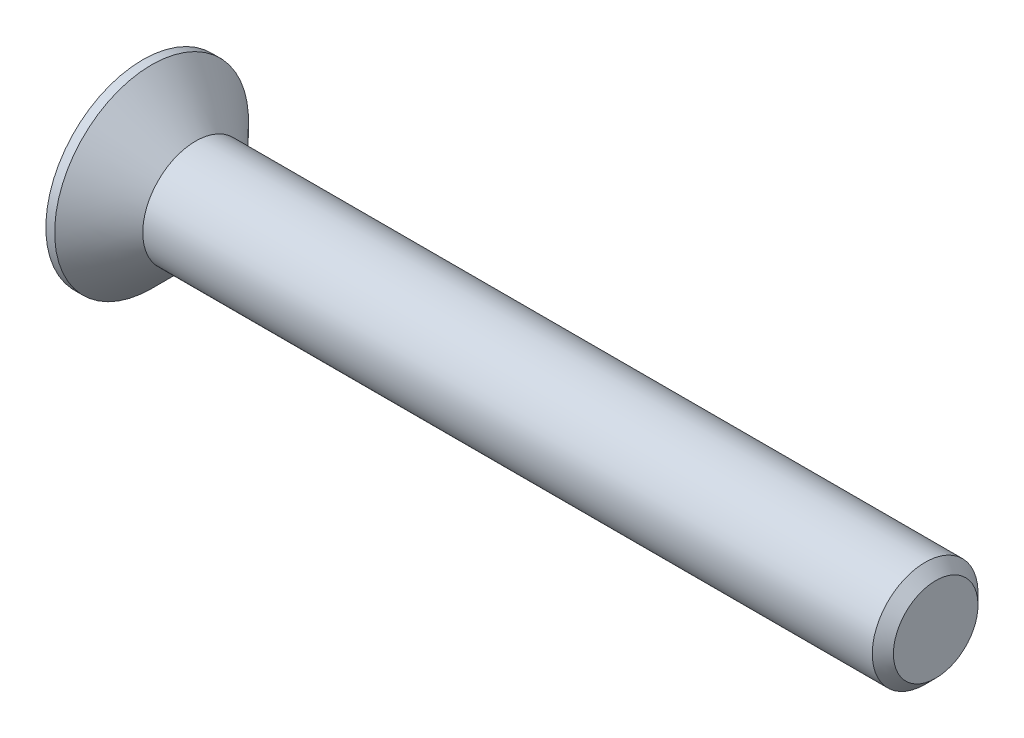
ISO-10303-21;
HEADER;
FILE_DESCRIPTION(('STEP AP214'),'2;1');
FILE_NAME('part.step','',(''),(''),'','','');
FILE_SCHEMA(('AUTOMOTIVE_DESIGN { 1 0 10303 214 1 1 1 1 }'));
ENDSEC;
DATA;
#1=APPLICATION_CONTEXT('core data for automotive mechanical design processes');
#2=APPLICATION_PROTOCOL_DEFINITION('international standard','automotive_design',2000,#1);
#3=PRODUCT_CONTEXT('',#1,'mechanical');
#4=PRODUCT('Part','Part','',(#3));
#5=PRODUCT_RELATED_PRODUCT_CATEGORY('part','',(#4));
#6=PRODUCT_DEFINITION_FORMATION('','',#4);
#7=PRODUCT_DEFINITION_CONTEXT('part definition',#1,'design');
#8=PRODUCT_DEFINITION('design','',#6,#7);
#9=PRODUCT_DEFINITION_SHAPE('','',#8);
#10=(LENGTH_UNIT() NAMED_UNIT(*) SI_UNIT(.MILLI.,.METRE.));
#11=(NAMED_UNIT(*) PLANE_ANGLE_UNIT() SI_UNIT($,.RADIAN.));
#12=(NAMED_UNIT(*) SI_UNIT($,.STERADIAN.) SOLID_ANGLE_UNIT());
#13=UNCERTAINTY_MEASURE_WITH_UNIT(LENGTH_MEASURE(1.E-05),#10,'distance_accuracy_value','');
#14=(GEOMETRIC_REPRESENTATION_CONTEXT(3) GLOBAL_UNCERTAINTY_ASSIGNED_CONTEXT((#13)) GLOBAL_UNIT_ASSIGNED_CONTEXT((#10,
#11,#12)) REPRESENTATION_CONTEXT('',''));
#15=CARTESIAN_POINT('',(0.,0.,0.));
#16=DIRECTION('',(0.,0.,1.));
#17=DIRECTION('',(1.,0.,0.));
#18=AXIS2_PLACEMENT_3D('',#15,#16,#17);
#19=CARTESIAN_POINT('',(0.,0.,0.));
#20=DIRECTION('',(-1.,0.,0.));
#21=DIRECTION('',(0.,-1.,0.));
#22=AXIS2_PLACEMENT_3D('',#19,#20,#21);
#23=CONICAL_SURFACE('',#22,3.,0.78539816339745);
#24=CARTESIAN_POINT('',(-2.49999999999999,0.,0.));
#25=DIRECTION('',(-1.,0.,0.));
#26=DIRECTION('',(0.,-1.,0.));
#27=AXIS2_PLACEMENT_3D('',#24,#25,#26);
#28=CIRCLE('',#27,5.5);
#29=CARTESIAN_POINT('',(-2.49999999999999,-5.5,0.));
#30=VERTEX_POINT('',#29);
#31=EDGE_CURVE('E189',#30,#30,#28,.T.);
#32=ORIENTED_EDGE('',*,*,#31,.F.);
#33=EDGE_LOOP('',(#32));
#34=FACE_BOUND('',#33,.T.);
#35=CARTESIAN_POINT('',(0.,0.,0.));
#36=DIRECTION('',(-1.,0.,0.));
#37=DIRECTION('',(0.,-1.,0.));
#38=AXIS2_PLACEMENT_3D('',#35,#36,#37);
#39=CIRCLE('',#38,3.);
#40=CARTESIAN_POINT('',(0.,-3.,0.));
#41=VERTEX_POINT('',#40);
#42=EDGE_CURVE('E212',#41,#41,#39,.T.);
#43=ORIENTED_EDGE('',*,*,#42,.T.);
#44=EDGE_LOOP('',(#43));
#45=FACE_BOUND('',#44,.T.);
#46=ADVANCED_FACE('F33',(#34,#45),#23,.T.);
#47=CARTESIAN_POINT('',(-3.,0.,0.));
#48=DIRECTION('',(-1.,0.,0.));
#49=DIRECTION('',(0.,-1.,0.));
#50=AXIS2_PLACEMENT_3D('',#47,#48,#49);
#51=CYLINDRICAL_SURFACE('',#50,3.);
#52=CARTESIAN_POINT('',(41.4,0.,0.));
#53=DIRECTION('',(-1.,0.,0.));
#54=DIRECTION('',(0.,-1.,0.));
#55=AXIS2_PLACEMENT_3D('',#52,#53,#54);
#56=CIRCLE('',#55,3.);
#57=CARTESIAN_POINT('',(41.4,-3.,0.));
#58=VERTEX_POINT('',#57);
#59=EDGE_CURVE('E41',#58,#58,#56,.T.);
#60=ORIENTED_EDGE('',*,*,#59,.T.);
#61=EDGE_LOOP('',(#60));
#62=FACE_BOUND('',#61,.T.);
#63=ORIENTED_EDGE('',*,*,#42,.F.);
#64=EDGE_LOOP('',(#63));
#65=FACE_BOUND('',#64,.T.);
#66=ADVANCED_FACE('F217',(#62,#65),#51,.T.);
#67=CARTESIAN_POINT('',(42.,0.,0.));
#68=DIRECTION('',(-1.,0.,0.));
#69=DIRECTION('',(0.,-1.,0.));
#70=AXIS2_PLACEMENT_3D('',#67,#68,#69);
#71=PLANE('',#70);
#72=CARTESIAN_POINT('',(42.,0.,0.));
#73=DIRECTION('',(-1.,0.,0.));
#74=DIRECTION('',(0.,-1.,0.));
#75=AXIS2_PLACEMENT_3D('',#72,#73,#74);
#76=CIRCLE('',#75,2.40000000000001);
#77=CARTESIAN_POINT('',(42.,-2.40000000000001,0.));
#78=VERTEX_POINT('',#77);
#79=EDGE_CURVE('E11',#78,#78,#76,.F.);
#80=ORIENTED_EDGE('',*,*,#79,.T.);
#81=EDGE_LOOP('',(#80));
#82=FACE_BOUND('',#81,.T.);
#83=ADVANCED_FACE('F239',(#82),#71,.F.);
#84=CARTESIAN_POINT('',(-3.,5.5,0.));
#85=DIRECTION('',(1.,0.,0.));
#86=DIRECTION('',(0.,1.,0.));
#87=AXIS2_PLACEMENT_3D('',#84,#85,#86);
#88=PLANE('',#87);
#89=DIRECTION('',(0.,0.,-1.));
#90=VECTOR('',#89,1.);
#91=CARTESIAN_POINT('',(-3.,0.825,-3.3));
#92=LINE('',#91,#90);
#93=CARTESIAN_POINT('',(-3.,0.825,-0.825));
#94=VERTEX_POINT('',#93);
#95=CARTESIAN_POINT('',(-3.,0.825,-3.3));
#96=VERTEX_POINT('',#95);
#97=EDGE_CURVE('E158',#94,#96,#92,.T.);
#98=ORIENTED_EDGE('',*,*,#97,.F.);
#99=DIRECTION('',(0.,-1.,0.));
#100=VECTOR('',#99,1.);
#101=CARTESIAN_POINT('',(-3.,0.825,-0.825));
#102=LINE('',#101,#100);
#103=CARTESIAN_POINT('',(-3.,3.3,-0.825));
#104=VERTEX_POINT('',#103);
#105=EDGE_CURVE('E48',#104,#94,#102,.T.);
#106=ORIENTED_EDGE('',*,*,#105,.F.);
#107=DIRECTION('',(0.,0.,-1.));
#108=VECTOR('',#107,1.);
#109=CARTESIAN_POINT('',(-3.,3.3,-0.825));
#110=LINE('',#109,#108);
#111=CARTESIAN_POINT('',(-3.,3.3,0.825));
#112=VERTEX_POINT('',#111);
#113=EDGE_CURVE('E185',#112,#104,#110,.T.);
#114=ORIENTED_EDGE('',*,*,#113,.F.);
#115=DIRECTION('',(0.,1.,0.));
#116=VECTOR('',#115,1.);
#117=CARTESIAN_POINT('',(-3.,3.3,0.825));
#118=LINE('',#117,#116);
#119=CARTESIAN_POINT('',(-3.,0.825,0.825));
#120=VERTEX_POINT('',#119);
#121=EDGE_CURVE('E183',#120,#112,#118,.T.);
#122=ORIENTED_EDGE('',*,*,#121,.F.);
#123=DIRECTION('',(0.,0.,-1.));
#124=VECTOR('',#123,1.);
#125=CARTESIAN_POINT('',(-3.,0.825,0.825));
#126=LINE('',#125,#124);
#127=CARTESIAN_POINT('',(-3.,0.825,3.3));
#128=VERTEX_POINT('',#127);
#129=EDGE_CURVE('E132',#128,#120,#126,.T.);
#130=ORIENTED_EDGE('',*,*,#129,.F.);
#131=DIRECTION('',(0.,1.,0.));
#132=VECTOR('',#131,1.);
#133=CARTESIAN_POINT('',(-3.,0.825,3.3));
#134=LINE('',#133,#132);
#135=CARTESIAN_POINT('',(-3.,-0.825,3.3));
#136=VERTEX_POINT('',#135);
#137=EDGE_CURVE('E179',#136,#128,#134,.T.);
#138=ORIENTED_EDGE('',*,*,#137,.F.);
#139=DIRECTION('',(0.,0.,1.));
#140=VECTOR('',#139,1.);
#141=CARTESIAN_POINT('',(-3.,-0.825,3.3));
#142=LINE('',#141,#140);
#143=CARTESIAN_POINT('',(-3.,-0.825,0.825));
#144=VERTEX_POINT('',#143);
#145=EDGE_CURVE('E176',#144,#136,#142,.T.);
#146=ORIENTED_EDGE('',*,*,#145,.F.);
#147=DIRECTION('',(0.,1.,0.));
#148=VECTOR('',#147,1.);
#149=CARTESIAN_POINT('',(-3.,-0.825,0.825));
#150=LINE('',#149,#148);
#151=CARTESIAN_POINT('',(-3.,-3.3,0.825));
#152=VERTEX_POINT('',#151);
#153=EDGE_CURVE('E173',#152,#144,#150,.T.);
#154=ORIENTED_EDGE('',*,*,#153,.F.);
#155=DIRECTION('',(0.,0.,1.));
#156=VECTOR('',#155,1.);
#157=CARTESIAN_POINT('',(-3.,-3.3,0.825));
#158=LINE('',#157,#156);
#159=CARTESIAN_POINT('',(-3.,-3.3,-0.825));
#160=VERTEX_POINT('',#159);
#161=EDGE_CURVE('E170',#160,#152,#158,.T.);
#162=ORIENTED_EDGE('',*,*,#161,.F.);
#163=DIRECTION('',(0.,-1.,0.));
#164=VECTOR('',#163,1.);
#165=CARTESIAN_POINT('',(-3.,-3.3,-0.825));
#166=LINE('',#165,#164);
#167=CARTESIAN_POINT('',(-3.,-0.825,-0.825));
#168=VERTEX_POINT('',#167);
#169=EDGE_CURVE('E167',#168,#160,#166,.T.);
#170=ORIENTED_EDGE('',*,*,#169,.F.);
#171=DIRECTION('',(0.,0.,1.));
#172=VECTOR('',#171,1.);
#173=CARTESIAN_POINT('',(-3.,-0.825,-0.825));
#174=LINE('',#173,#172);
#175=CARTESIAN_POINT('',(-3.,-0.825,-3.3));
#176=VERTEX_POINT('',#175);
#177=EDGE_CURVE('E164',#176,#168,#174,.T.);
#178=ORIENTED_EDGE('',*,*,#177,.F.);
#179=DIRECTION('',(0.,-1.,0.));
#180=VECTOR('',#179,1.);
#181=CARTESIAN_POINT('',(-3.,-0.825,-3.3));
#182=LINE('',#181,#180);
#183=EDGE_CURVE('E161',#96,#176,#182,.T.);
#184=ORIENTED_EDGE('',*,*,#183,.F.);
#185=EDGE_LOOP('',(#98,#106,#114,#122,#130,#138,#146,#154,#162,#170,#178,#184));
#186=FACE_BOUND('',#185,.T.);
#187=CARTESIAN_POINT('',(-3.,0.,0.));
#188=DIRECTION('',(-1.,0.,0.));
#189=DIRECTION('',(0.,-1.,0.));
#190=AXIS2_PLACEMENT_3D('',#187,#188,#189);
#191=CIRCLE('',#190,5.5);
#192=CARTESIAN_POINT('',(-3.,-5.5,0.));
#193=VERTEX_POINT('',#192);
#194=EDGE_CURVE('E209',#193,#193,#191,.T.);
#195=ORIENTED_EDGE('',*,*,#194,.T.);
#196=EDGE_LOOP('',(#195));
#197=FACE_BOUND('',#196,.T.);
#198=ADVANCED_FACE('F230',(#186,#197),#88,.F.);
#199=CARTESIAN_POINT('',(-3.,0.,0.));
#200=DIRECTION('',(-1.,0.,0.));
#201=DIRECTION('',(0.,-1.,0.));
#202=AXIS2_PLACEMENT_3D('',#199,#200,#201);
#203=CYLINDRICAL_SURFACE('',#202,5.5);
#204=ORIENTED_EDGE('',*,*,#194,.F.);
#205=EDGE_LOOP('',(#204));
#206=FACE_BOUND('',#205,.T.);
#207=ORIENTED_EDGE('',*,*,#31,.T.);
#208=EDGE_LOOP('',(#207));
#209=FACE_BOUND('',#208,.T.);
#210=ADVANCED_FACE('F222',(#206,#209),#203,.T.);
#211=CARTESIAN_POINT('',(41.4,0.,0.));
#212=DIRECTION('',(-1.,0.,0.));
#213=DIRECTION('',(0.,-1.,0.));
#214=AXIS2_PLACEMENT_3D('',#211,#212,#213);
#215=CONICAL_SURFACE('',#214,3.,0.785398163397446);
#216=ORIENTED_EDGE('',*,*,#79,.F.);
#217=EDGE_LOOP('',(#216));
#218=FACE_BOUND('',#217,.T.);
#219=ORIENTED_EDGE('',*,*,#59,.F.);
#220=EDGE_LOOP('',(#219));
#221=FACE_BOUND('',#220,.T.);
#222=ADVANCED_FACE('F35',(#218,#221),#215,.T.);
#223=CARTESIAN_POINT('',(-0.5,0.825,-0.825));
#224=DIRECTION('',(0.,0.,-1.));
#225=DIRECTION('',(-1.,0.,0.));
#226=AXIS2_PLACEMENT_3D('',#223,#224,#225);
#227=PLANE('',#226);
#228=ORIENTED_EDGE('',*,*,#105,.T.);
#229=DIRECTION('',(-1.,0.,0.));
#230=VECTOR('',#229,1.);
#231=CARTESIAN_POINT('',(-0.5,0.825,-0.825));
#232=LINE('',#231,#230);
#233=CARTESIAN_POINT('',(-0.5,0.825,-0.825));
#234=VERTEX_POINT('',#233);
#235=EDGE_CURVE('E96',#234,#94,#232,.T.);
#236=ORIENTED_EDGE('',*,*,#235,.F.);
#237=DIRECTION('',(0.,-1.,0.));
#238=VECTOR('',#237,1.);
#239=CARTESIAN_POINT('',(-0.5,0.825,-0.825));
#240=LINE('',#239,#238);
#241=CARTESIAN_POINT('',(-0.5,3.3,-0.825));
#242=VERTEX_POINT('',#241);
#243=EDGE_CURVE('E187',#242,#234,#240,.T.);
#244=ORIENTED_EDGE('',*,*,#243,.F.);
#245=DIRECTION('',(-1.,0.,0.));
#246=VECTOR('',#245,1.);
#247=CARTESIAN_POINT('',(-0.5,3.3,-0.825));
#248=LINE('',#247,#246);
#249=EDGE_CURVE('E56',#242,#104,#248,.T.);
#250=ORIENTED_EDGE('',*,*,#249,.T.);
#251=EDGE_LOOP('',(#228,#236,#244,#250));
#252=FACE_BOUND('',#251,.T.);
#253=ADVANCED_FACE('F221',(#252),#227,.F.);
#254=CARTESIAN_POINT('',(-0.5,3.3,-0.825));
#255=DIRECTION('',(0.,1.,0.));
#256=DIRECTION('',(-1.,0.,0.));
#257=AXIS2_PLACEMENT_3D('',#254,#255,#256);
#258=PLANE('',#257);
#259=ORIENTED_EDGE('',*,*,#113,.T.);
#260=ORIENTED_EDGE('',*,*,#249,.F.);
#261=DIRECTION('',(0.,0.,-1.));
#262=VECTOR('',#261,1.);
#263=CARTESIAN_POINT('',(-0.5,3.3,-0.825));
#264=LINE('',#263,#262);
#265=CARTESIAN_POINT('',(-0.5,3.3,0.825));
#266=VERTEX_POINT('',#265);
#267=EDGE_CURVE('E144',#266,#242,#264,.T.);
#268=ORIENTED_EDGE('',*,*,#267,.F.);
#269=DIRECTION('',(-1.,0.,0.));
#270=VECTOR('',#269,1.);
#271=CARTESIAN_POINT('',(-0.5,3.3,0.825));
#272=LINE('',#271,#270);
#273=EDGE_CURVE('E136',#266,#112,#272,.T.);
#274=ORIENTED_EDGE('',*,*,#273,.T.);
#275=EDGE_LOOP('',(#259,#260,#268,#274));
#276=FACE_BOUND('',#275,.T.);
#277=ADVANCED_FACE('F228',(#276),#258,.F.);
#278=CARTESIAN_POINT('',(-0.5,3.3,0.825));
#279=DIRECTION('',(0.,0.,1.));
#280=DIRECTION('',(1.,0.,0.));
#281=AXIS2_PLACEMENT_3D('',#278,#279,#280);
#282=PLANE('',#281);
#283=ORIENTED_EDGE('',*,*,#121,.T.);
#284=ORIENTED_EDGE('',*,*,#273,.F.);
#285=DIRECTION('',(0.,1.,0.));
#286=VECTOR('',#285,1.);
#287=CARTESIAN_POINT('',(-0.5,3.3,0.825));
#288=LINE('',#287,#286);
#289=CARTESIAN_POINT('',(-0.5,0.825,0.825));
#290=VERTEX_POINT('',#289);
#291=EDGE_CURVE('E140',#290,#266,#288,.T.);
#292=ORIENTED_EDGE('',*,*,#291,.F.);
#293=DIRECTION('',(-1.,0.,0.));
#294=VECTOR('',#293,1.);
#295=CARTESIAN_POINT('',(-0.5,0.825,0.825));
#296=LINE('',#295,#294);
#297=EDGE_CURVE('E125',#290,#120,#296,.T.);
#298=ORIENTED_EDGE('',*,*,#297,.T.);
#299=EDGE_LOOP('',(#283,#284,#292,#298));
#300=FACE_BOUND('',#299,.T.);
#301=ADVANCED_FACE('F141',(#300),#282,.F.);
#302=CARTESIAN_POINT('',(-0.5,0.825,0.825));
#303=DIRECTION('',(0.,1.,0.));
#304=DIRECTION('',(-1.,0.,0.));
#305=AXIS2_PLACEMENT_3D('',#302,#303,#304);
#306=PLANE('',#305);
#307=ORIENTED_EDGE('',*,*,#129,.T.);
#308=ORIENTED_EDGE('',*,*,#297,.F.);
#309=DIRECTION('',(0.,0.,-1.));
#310=VECTOR('',#309,1.);
#311=CARTESIAN_POINT('',(-0.5,0.825,0.825));
#312=LINE('',#311,#310);
#313=CARTESIAN_POINT('',(-0.5,0.825,3.3));
#314=VERTEX_POINT('',#313);
#315=EDGE_CURVE('E129',#314,#290,#312,.T.);
#316=ORIENTED_EDGE('',*,*,#315,.F.);
#317=DIRECTION('',(-1.,0.,0.));
#318=VECTOR('',#317,1.);
#319=CARTESIAN_POINT('',(-0.5,0.825,3.3));
#320=LINE('',#319,#318);
#321=EDGE_CURVE('E137',#314,#128,#320,.T.);
#322=ORIENTED_EDGE('',*,*,#321,.T.);
#323=EDGE_LOOP('',(#307,#308,#316,#322));
#324=FACE_BOUND('',#323,.T.);
#325=ADVANCED_FACE('F127',(#324),#306,.F.);
#326=CARTESIAN_POINT('',(-0.5,0.825,3.3));
#327=DIRECTION('',(0.,0.,1.));
#328=DIRECTION('',(1.,0.,0.));
#329=AXIS2_PLACEMENT_3D('',#326,#327,#328);
#330=PLANE('',#329);
#331=ORIENTED_EDGE('',*,*,#137,.T.);
#332=ORIENTED_EDGE('',*,*,#321,.F.);
#333=DIRECTION('',(0.,1.,0.));
#334=VECTOR('',#333,1.);
#335=CARTESIAN_POINT('',(-0.5,0.825,3.3));
#336=LINE('',#335,#334);
#337=CARTESIAN_POINT('',(-0.5,-0.825,3.3));
#338=VERTEX_POINT('',#337);
#339=EDGE_CURVE('E150',#338,#314,#336,.T.);
#340=ORIENTED_EDGE('',*,*,#339,.F.);
#341=DIRECTION('',(-1.,0.,0.));
#342=VECTOR('',#341,1.);
#343=CARTESIAN_POINT('',(-0.5,-0.825,3.3));
#344=LINE('',#343,#342);
#345=EDGE_CURVE('E192',#338,#136,#344,.T.);
#346=ORIENTED_EDGE('',*,*,#345,.T.);
#347=EDGE_LOOP('',(#331,#332,#340,#346));
#348=FACE_BOUND('',#347,.T.);
#349=ADVANCED_FACE('F277',(#348),#330,.F.);
#350=CARTESIAN_POINT('',(-0.5,-0.825,3.3));
#351=DIRECTION('',(0.,-1.,0.));
#352=DIRECTION('',(1.,0.,0.));
#353=AXIS2_PLACEMENT_3D('',#350,#351,#352);
#354=PLANE('',#353);
#355=ORIENTED_EDGE('',*,*,#145,.T.);
#356=ORIENTED_EDGE('',*,*,#345,.F.);
#357=DIRECTION('',(0.,0.,1.));
#358=VECTOR('',#357,1.);
#359=CARTESIAN_POINT('',(-0.5,-0.825,3.3));
#360=LINE('',#359,#358);
#361=CARTESIAN_POINT('',(-0.5,-0.825,0.825));
#362=VERTEX_POINT('',#361);
#363=EDGE_CURVE('E152',#362,#338,#360,.T.);
#364=ORIENTED_EDGE('',*,*,#363,.F.);
#365=DIRECTION('',(-1.,0.,0.));
#366=VECTOR('',#365,1.);
#367=CARTESIAN_POINT('',(-0.5,-0.825,0.825));
#368=LINE('',#367,#366);
#369=EDGE_CURVE('E194',#362,#144,#368,.T.);
#370=ORIENTED_EDGE('',*,*,#369,.T.);
#371=EDGE_LOOP('',(#355,#356,#364,#370));
#372=FACE_BOUND('',#371,.T.);
#373=ADVANCED_FACE('F273',(#372),#354,.F.);
#374=CARTESIAN_POINT('',(-0.5,-0.825,0.825));
#375=DIRECTION('',(0.,0.,1.));
#376=DIRECTION('',(1.,0.,0.));
#377=AXIS2_PLACEMENT_3D('',#374,#375,#376);
#378=PLANE('',#377);
#379=ORIENTED_EDGE('',*,*,#153,.T.);
#380=ORIENTED_EDGE('',*,*,#369,.F.);
#381=DIRECTION('',(0.,1.,0.));
#382=VECTOR('',#381,1.);
#383=CARTESIAN_POINT('',(-0.5,-0.825,0.825));
#384=LINE('',#383,#382);
#385=CARTESIAN_POINT('',(-0.5,-3.3,0.825));
#386=VERTEX_POINT('',#385);
#387=EDGE_CURVE('E422',#386,#362,#384,.T.);
#388=ORIENTED_EDGE('',*,*,#387,.F.);
#389=DIRECTION('',(-1.,0.,0.));
#390=VECTOR('',#389,1.);
#391=CARTESIAN_POINT('',(-0.5,-3.3,0.825));
#392=LINE('',#391,#390);
#393=EDGE_CURVE('E196',#386,#152,#392,.T.);
#394=ORIENTED_EDGE('',*,*,#393,.T.);
#395=EDGE_LOOP('',(#379,#380,#388,#394));
#396=FACE_BOUND('',#395,.T.);
#397=ADVANCED_FACE('F269',(#396),#378,.F.);
#398=CARTESIAN_POINT('',(-0.5,-3.3,0.825));
#399=DIRECTION('',(0.,-1.,0.));
#400=DIRECTION('',(1.,0.,0.));
#401=AXIS2_PLACEMENT_3D('',#398,#399,#400);
#402=PLANE('',#401);
#403=ORIENTED_EDGE('',*,*,#161,.T.);
#404=ORIENTED_EDGE('',*,*,#393,.F.);
#405=DIRECTION('',(0.,0.,1.));
#406=VECTOR('',#405,1.);
#407=CARTESIAN_POINT('',(-0.5,-3.3,0.825));
#408=LINE('',#407,#406);
#409=CARTESIAN_POINT('',(-0.5,-3.3,-0.825));
#410=VERTEX_POINT('',#409);
#411=EDGE_CURVE('E419',#410,#386,#408,.T.);
#412=ORIENTED_EDGE('',*,*,#411,.F.);
#413=DIRECTION('',(-1.,0.,0.));
#414=VECTOR('',#413,1.);
#415=CARTESIAN_POINT('',(-0.5,-3.3,-0.825));
#416=LINE('',#415,#414);
#417=EDGE_CURVE('E198',#410,#160,#416,.T.);
#418=ORIENTED_EDGE('',*,*,#417,.T.);
#419=EDGE_LOOP('',(#403,#404,#412,#418));
#420=FACE_BOUND('',#419,.T.);
#421=ADVANCED_FACE('F265',(#420),#402,.F.);
#422=CARTESIAN_POINT('',(-0.5,-3.3,-0.825));
#423=DIRECTION('',(0.,0.,-1.));
#424=DIRECTION('',(-1.,0.,0.));
#425=AXIS2_PLACEMENT_3D('',#422,#423,#424);
#426=PLANE('',#425);
#427=ORIENTED_EDGE('',*,*,#169,.T.);
#428=ORIENTED_EDGE('',*,*,#417,.F.);
#429=DIRECTION('',(0.,-1.,0.));
#430=VECTOR('',#429,1.);
#431=CARTESIAN_POINT('',(-0.5,-3.3,-0.825));
#432=LINE('',#431,#430);
#433=CARTESIAN_POINT('',(-0.5,-0.825,-0.825));
#434=VERTEX_POINT('',#433);
#435=EDGE_CURVE('E416',#434,#410,#432,.T.);
#436=ORIENTED_EDGE('',*,*,#435,.F.);
#437=DIRECTION('',(-1.,0.,0.));
#438=VECTOR('',#437,1.);
#439=CARTESIAN_POINT('',(-0.5,-0.825,-0.825));
#440=LINE('',#439,#438);
#441=EDGE_CURVE('E200',#434,#168,#440,.T.);
#442=ORIENTED_EDGE('',*,*,#441,.T.);
#443=EDGE_LOOP('',(#427,#428,#436,#442));
#444=FACE_BOUND('',#443,.T.);
#445=ADVANCED_FACE('F261',(#444),#426,.F.);
#446=CARTESIAN_POINT('',(-0.5,-0.825,-0.825));
#447=DIRECTION('',(0.,-1.,0.));
#448=DIRECTION('',(1.,0.,0.));
#449=AXIS2_PLACEMENT_3D('',#446,#447,#448);
#450=PLANE('',#449);
#451=ORIENTED_EDGE('',*,*,#177,.T.);
#452=ORIENTED_EDGE('',*,*,#441,.F.);
#453=DIRECTION('',(0.,0.,1.));
#454=VECTOR('',#453,1.);
#455=CARTESIAN_POINT('',(-0.5,-0.825,-0.825));
#456=LINE('',#455,#454);
#457=CARTESIAN_POINT('',(-0.5,-0.825,-3.3));
#458=VERTEX_POINT('',#457);
#459=EDGE_CURVE('E413',#458,#434,#456,.T.);
#460=ORIENTED_EDGE('',*,*,#459,.F.);
#461=DIRECTION('',(-1.,0.,0.));
#462=VECTOR('',#461,1.);
#463=CARTESIAN_POINT('',(-0.5,-0.825,-3.3));
#464=LINE('',#463,#462);
#465=EDGE_CURVE('E202',#458,#176,#464,.T.);
#466=ORIENTED_EDGE('',*,*,#465,.T.);
#467=EDGE_LOOP('',(#451,#452,#460,#466));
#468=FACE_BOUND('',#467,.T.);
#469=ADVANCED_FACE('F257',(#468),#450,.F.);
#470=CARTESIAN_POINT('',(-0.5,-0.825,-3.3));
#471=DIRECTION('',(0.,0.,-1.));
#472=DIRECTION('',(-1.,0.,0.));
#473=AXIS2_PLACEMENT_3D('',#470,#471,#472);
#474=PLANE('',#473);
#475=ORIENTED_EDGE('',*,*,#183,.T.);
#476=ORIENTED_EDGE('',*,*,#465,.F.);
#477=DIRECTION('',(0.,-1.,0.));
#478=VECTOR('',#477,1.);
#479=CARTESIAN_POINT('',(-0.5,-0.825,-3.3));
#480=LINE('',#479,#478);
#481=CARTESIAN_POINT('',(-0.5,0.825,-3.3));
#482=VERTEX_POINT('',#481);
#483=EDGE_CURVE('E408',#482,#458,#480,.T.);
#484=ORIENTED_EDGE('',*,*,#483,.F.);
#485=DIRECTION('',(-1.,0.,0.));
#486=VECTOR('',#485,1.);
#487=CARTESIAN_POINT('',(-0.5,0.825,-3.3));
#488=LINE('',#487,#486);
#489=EDGE_CURVE('E204',#482,#96,#488,.T.);
#490=ORIENTED_EDGE('',*,*,#489,.T.);
#491=EDGE_LOOP('',(#475,#476,#484,#490));
#492=FACE_BOUND('',#491,.T.);
#493=ADVANCED_FACE('F253',(#492),#474,.F.);
#494=CARTESIAN_POINT('',(-0.5,0.825,-3.3));
#495=DIRECTION('',(0.,1.,0.));
#496=DIRECTION('',(-1.,0.,0.));
#497=AXIS2_PLACEMENT_3D('',#494,#495,#496);
#498=PLANE('',#497);
#499=ORIENTED_EDGE('',*,*,#97,.T.);
#500=ORIENTED_EDGE('',*,*,#489,.F.);
#501=DIRECTION('',(0.,0.,-1.));
#502=VECTOR('',#501,1.);
#503=CARTESIAN_POINT('',(-0.5,0.825,-3.3));
#504=LINE('',#503,#502);
#505=EDGE_CURVE('E406',#234,#482,#504,.T.);
#506=ORIENTED_EDGE('',*,*,#505,.F.);
#507=ORIENTED_EDGE('',*,*,#235,.T.);
#508=EDGE_LOOP('',(#499,#500,#506,#507));
#509=FACE_BOUND('',#508,.T.);
#510=ADVANCED_FACE('F250',(#509),#498,.F.);
#511=CARTESIAN_POINT('',(-0.5,0.,0.));
#512=DIRECTION('',(1.,0.,0.));
#513=DIRECTION('',(0.,0.,-1.));
#514=AXIS2_PLACEMENT_3D('',#511,#512,#513);
#515=PLANE('',#514);
#516=ORIENTED_EDGE('',*,*,#243,.T.);
#517=ORIENTED_EDGE('',*,*,#505,.T.);
#518=ORIENTED_EDGE('',*,*,#483,.T.);
#519=ORIENTED_EDGE('',*,*,#459,.T.);
#520=ORIENTED_EDGE('',*,*,#435,.T.);
#521=ORIENTED_EDGE('',*,*,#411,.T.);
#522=ORIENTED_EDGE('',*,*,#387,.T.);
#523=ORIENTED_EDGE('',*,*,#363,.T.);
#524=ORIENTED_EDGE('',*,*,#339,.T.);
#525=ORIENTED_EDGE('',*,*,#315,.T.);
#526=ORIENTED_EDGE('',*,*,#291,.T.);
#527=ORIENTED_EDGE('',*,*,#267,.T.);
#528=EDGE_LOOP('',(#516,#517,#518,#519,#520,#521,#522,#523,#524,#525,#526,#527));
#529=FACE_BOUND('',#528,.T.);
#530=ADVANCED_FACE('F147',(#529),#515,.F.);
#531=CLOSED_SHELL('',(#46,#66,#83,#198,#210,#222,#253,#277,#301,#325,#349,#373,#397,#421,#445,
#469,#493,#510,#530));
#532=MANIFOLD_SOLID_BREP('B2',#531);
#533=ADVANCED_BREP_SHAPE_REPRESENTATION('',(#18,#532),#14);
#534=SHAPE_DEFINITION_REPRESENTATION(#9,#533);
ENDSEC;
END-ISO-10303-21;
